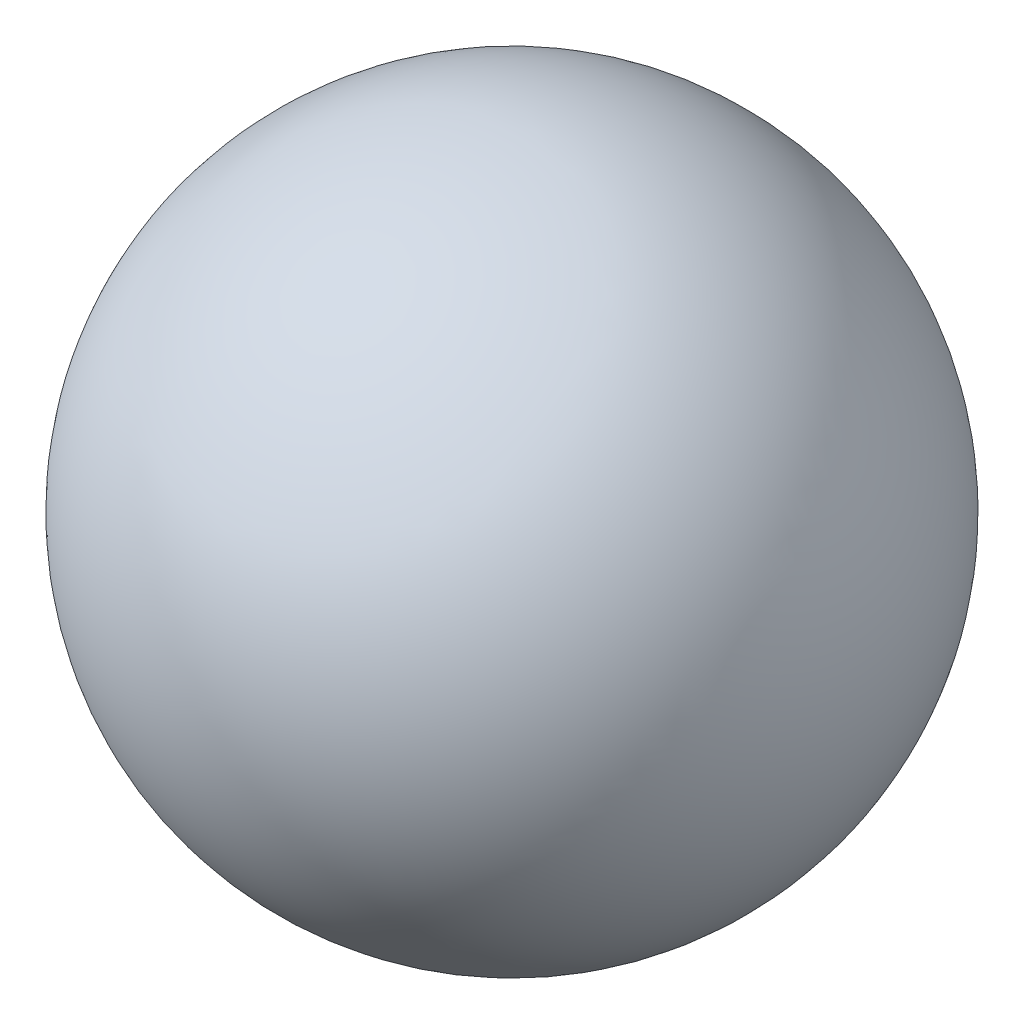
from build123d import *


with BuildPart() as part:
    # Sketch1 → Revolve1 (revolve)
    with BuildSketch(Plane.XY):
        with BuildLine():
            Line((-75, 0), (75, 0))
            ThreePointArc((75, 0), (0, 75), (-75, 0))
        make_face()
    revolve(axis=Axis((-49.932931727, 0, 0), (1, 0, 0)))


solid = part.part
